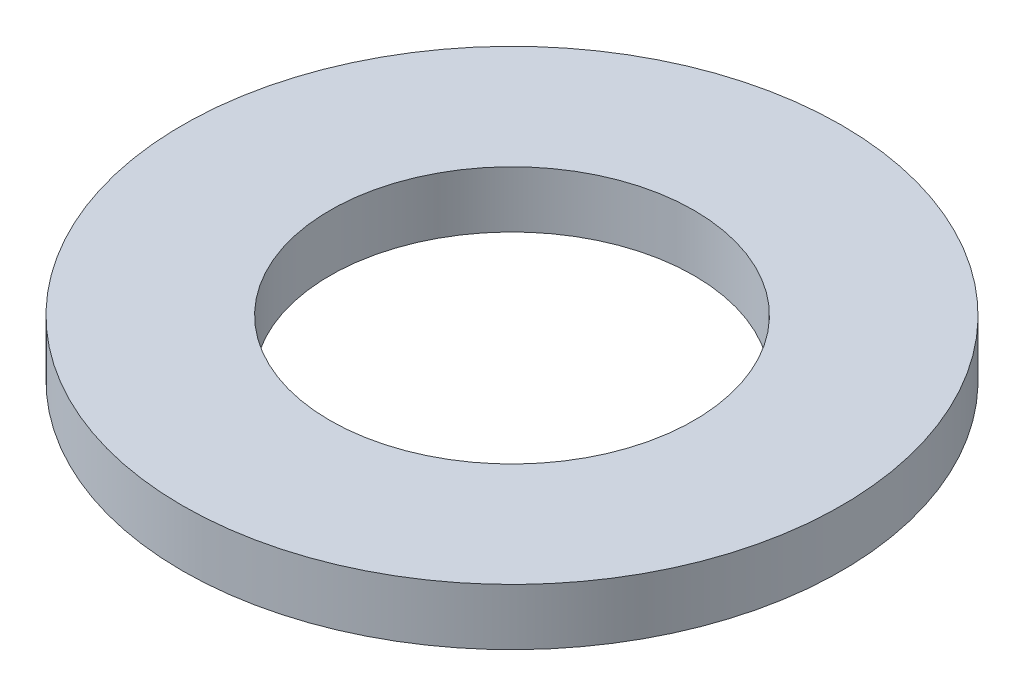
ISO-10303-21;
HEADER;
FILE_DESCRIPTION(('STEP AP214'),'2;1');
FILE_NAME('part.step','',(''),(''),'','','');
FILE_SCHEMA(('AUTOMOTIVE_DESIGN { 1 0 10303 214 1 1 1 1 }'));
ENDSEC;
DATA;
#1=APPLICATION_CONTEXT('core data for automotive mechanical design processes');
#2=APPLICATION_PROTOCOL_DEFINITION('international standard','automotive_design',2000,#1);
#3=PRODUCT_CONTEXT('',#1,'mechanical');
#4=PRODUCT('Part','Part','',(#3));
#5=PRODUCT_RELATED_PRODUCT_CATEGORY('part','',(#4));
#6=PRODUCT_DEFINITION_FORMATION('','',#4);
#7=PRODUCT_DEFINITION_CONTEXT('part definition',#1,'design');
#8=PRODUCT_DEFINITION('design','',#6,#7);
#9=PRODUCT_DEFINITION_SHAPE('','',#8);
#10=(LENGTH_UNIT() NAMED_UNIT(*) SI_UNIT(.MILLI.,.METRE.));
#11=(NAMED_UNIT(*) PLANE_ANGLE_UNIT() SI_UNIT($,.RADIAN.));
#12=(NAMED_UNIT(*) SI_UNIT($,.STERADIAN.) SOLID_ANGLE_UNIT());
#13=UNCERTAINTY_MEASURE_WITH_UNIT(LENGTH_MEASURE(1.E-05),#10,'distance_accuracy_value','');
#14=(GEOMETRIC_REPRESENTATION_CONTEXT(3) GLOBAL_UNCERTAINTY_ASSIGNED_CONTEXT((#13)) GLOBAL_UNIT_ASSIGNED_CONTEXT((#10,
#11,#12)) REPRESENTATION_CONTEXT('',''));
#15=CARTESIAN_POINT('',(0.,0.,0.));
#16=DIRECTION('',(0.,0.,1.));
#17=DIRECTION('',(1.,0.,0.));
#18=AXIS2_PLACEMENT_3D('',#15,#16,#17);
#19=CARTESIAN_POINT('',(0.,9.,0.));
#20=DIRECTION('',(0.,1.,0.));
#21=DIRECTION('',(0.,0.,1.));
#22=AXIS2_PLACEMENT_3D('',#19,#20,#21);
#23=PLANE('',#22);
#24=CARTESIAN_POINT('',(0.,9.,0.));
#25=DIRECTION('',(0.,1.,0.));
#26=DIRECTION('',(0.,0.,1.));
#27=AXIS2_PLACEMENT_3D('',#24,#25,#26);
#28=CIRCLE('',#27,52.5);
#29=CARTESIAN_POINT('',(0.,9.,52.5));
#30=VERTEX_POINT('',#29);
#31=EDGE_CURVE('E10',#30,#30,#28,.T.);
#32=ORIENTED_EDGE('',*,*,#31,.T.);
#33=EDGE_LOOP('',(#32));
#34=FACE_BOUND('',#33,.T.);
#35=CARTESIAN_POINT('',(0.,9.,0.));
#36=DIRECTION('',(0.,1.,0.));
#37=DIRECTION('',(0.,0.,1.));
#38=AXIS2_PLACEMENT_3D('',#35,#36,#37);
#39=CIRCLE('',#38,29.);
#40=CARTESIAN_POINT('',(0.,9.,29.));
#41=VERTEX_POINT('',#40);
#42=EDGE_CURVE('E39',#41,#41,#39,.T.);
#43=ORIENTED_EDGE('',*,*,#42,.F.);
#44=EDGE_LOOP('',(#43));
#45=FACE_BOUND('',#44,.T.);
#46=ADVANCED_FACE('F28',(#34,#45),#23,.T.);
#47=CARTESIAN_POINT('',(0.,0.,0.));
#48=DIRECTION('',(0.,1.,0.));
#49=DIRECTION('',(0.,0.,1.));
#50=AXIS2_PLACEMENT_3D('',#47,#48,#49);
#51=PLANE('',#50);
#52=CARTESIAN_POINT('',(0.,0.,0.));
#53=DIRECTION('',(0.,1.,0.));
#54=DIRECTION('',(0.,0.,1.));
#55=AXIS2_PLACEMENT_3D('',#52,#53,#54);
#56=CIRCLE('',#55,52.5);
#57=CARTESIAN_POINT('',(0.,0.,52.5));
#58=VERTEX_POINT('',#57);
#59=EDGE_CURVE('E35',#58,#58,#56,.T.);
#60=ORIENTED_EDGE('',*,*,#59,.F.);
#61=EDGE_LOOP('',(#60));
#62=FACE_BOUND('',#61,.T.);
#63=CARTESIAN_POINT('',(0.,0.,0.));
#64=DIRECTION('',(0.,1.,0.));
#65=DIRECTION('',(0.,0.,1.));
#66=AXIS2_PLACEMENT_3D('',#63,#64,#65);
#67=CIRCLE('',#66,29.);
#68=CARTESIAN_POINT('',(0.,0.,29.));
#69=VERTEX_POINT('',#68);
#70=EDGE_CURVE('E43',#69,#69,#67,.T.);
#71=ORIENTED_EDGE('',*,*,#70,.T.);
#72=EDGE_LOOP('',(#71));
#73=FACE_BOUND('',#72,.T.);
#74=ADVANCED_FACE('F49',(#62,#73),#51,.F.);
#75=CARTESIAN_POINT('',(0.,9.,0.));
#76=DIRECTION('',(0.,-1.,0.));
#77=DIRECTION('',(0.,0.,-1.));
#78=AXIS2_PLACEMENT_3D('',#75,#76,#77);
#79=CYLINDRICAL_SURFACE('',#78,52.5);
#80=ORIENTED_EDGE('',*,*,#31,.F.);
#81=EDGE_LOOP('',(#80));
#82=FACE_BOUND('',#81,.T.);
#83=ORIENTED_EDGE('',*,*,#59,.T.);
#84=EDGE_LOOP('',(#83));
#85=FACE_BOUND('',#84,.T.);
#86=ADVANCED_FACE('F30',(#82,#85),#79,.T.);
#87=CARTESIAN_POINT('',(0.,9.,0.));
#88=DIRECTION('',(0.,-1.,0.));
#89=DIRECTION('',(0.,0.,-1.));
#90=AXIS2_PLACEMENT_3D('',#87,#88,#89);
#91=CYLINDRICAL_SURFACE('',#90,29.);
#92=ORIENTED_EDGE('',*,*,#42,.T.);
#93=EDGE_LOOP('',(#92));
#94=FACE_BOUND('',#93,.T.);
#95=ORIENTED_EDGE('',*,*,#70,.F.);
#96=EDGE_LOOP('',(#95));
#97=FACE_BOUND('',#96,.T.);
#98=ADVANCED_FACE('F51',(#94,#97),#91,.F.);
#99=CLOSED_SHELL('',(#46,#74,#86,#98));
#100=MANIFOLD_SOLID_BREP('B2',#99);
#101=ADVANCED_BREP_SHAPE_REPRESENTATION('',(#18,#100),#14);
#102=SHAPE_DEFINITION_REPRESENTATION(#9,#101);
ENDSEC;
END-ISO-10303-21;
